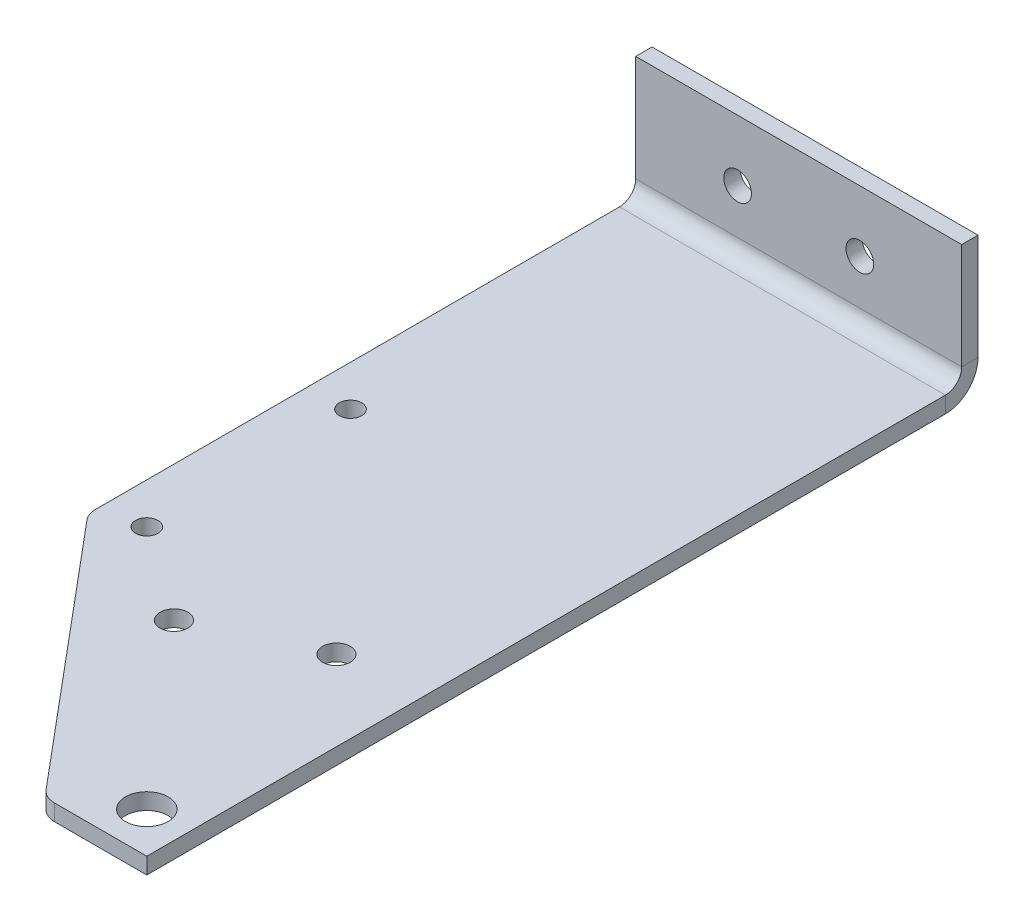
ISO-10303-21;
HEADER;
FILE_DESCRIPTION(('STEP AP214'),'2;1');
FILE_NAME('part.step','',(''),(''),'','','');
FILE_SCHEMA(('AUTOMOTIVE_DESIGN { 1 0 10303 214 1 1 1 1 }'));
ENDSEC;
DATA;
#1=APPLICATION_CONTEXT('core data for automotive mechanical design processes');
#2=APPLICATION_PROTOCOL_DEFINITION('international standard','automotive_design',2000,#1);
#3=PRODUCT_CONTEXT('',#1,'mechanical');
#4=PRODUCT('Part','Part','',(#3));
#5=PRODUCT_RELATED_PRODUCT_CATEGORY('part','',(#4));
#6=PRODUCT_DEFINITION_FORMATION('','',#4);
#7=PRODUCT_DEFINITION_CONTEXT('part definition',#1,'design');
#8=PRODUCT_DEFINITION('design','',#6,#7);
#9=PRODUCT_DEFINITION_SHAPE('','',#8);
#10=(LENGTH_UNIT() NAMED_UNIT(*) SI_UNIT(.MILLI.,.METRE.));
#11=(NAMED_UNIT(*) PLANE_ANGLE_UNIT() SI_UNIT($,.RADIAN.));
#12=(NAMED_UNIT(*) SI_UNIT($,.STERADIAN.) SOLID_ANGLE_UNIT());
#13=UNCERTAINTY_MEASURE_WITH_UNIT(LENGTH_MEASURE(1.E-05),#10,'distance_accuracy_value','');
#14=(GEOMETRIC_REPRESENTATION_CONTEXT(3) GLOBAL_UNCERTAINTY_ASSIGNED_CONTEXT((#13)) GLOBAL_UNIT_ASSIGNED_CONTEXT((#10,
#11,#12)) REPRESENTATION_CONTEXT('',''));
#15=CARTESIAN_POINT('',(0.,0.,0.));
#16=DIRECTION('',(0.,0.,1.));
#17=DIRECTION('',(1.,0.,0.));
#18=AXIS2_PLACEMENT_3D('',#15,#16,#17);
#19=CARTESIAN_POINT('',(-8.32667268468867E-13,-4.,200.));
#20=DIRECTION('',(0.,1.,0.));
#21=DIRECTION('',(0.,0.,1.));
#22=AXIS2_PLACEMENT_3D('',#19,#20,#21);
#23=PLANE('',#22);
#24=CARTESIAN_POINT('',(9.99999999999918,-4.00000000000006,130.));
#25=DIRECTION('',(0.,1.,0.));
#26=DIRECTION('',(0.,0.,1.));
#27=AXIS2_PLACEMENT_3D('',#24,#25,#26);
#28=CIRCLE('',#27,2.75);
#29=CARTESIAN_POINT('',(9.99999999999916,-4.00000000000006,132.75));
#30=VERTEX_POINT('',#29);
#31=EDGE_CURVE('E371',#30,#30,#28,.T.);
#32=ORIENTED_EDGE('',*,*,#31,.T.);
#33=EDGE_LOOP('',(#32));
#34=FACE_BOUND('',#33,.T.);
#35=CARTESIAN_POINT('',(10.,-4.00000000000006,79.9999999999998));
#36=DIRECTION('',(0.,1.,0.));
#37=DIRECTION('',(0.,0.,1.));
#38=AXIS2_PLACEMENT_3D('',#35,#36,#37);
#39=CIRCLE('',#38,2.75);
#40=CARTESIAN_POINT('',(9.99999999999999,-4.00000000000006,82.7499999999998));
#41=VERTEX_POINT('',#40);
#42=EDGE_CURVE('E375',#41,#41,#39,.T.);
#43=ORIENTED_EDGE('',*,*,#42,.T.);
#44=EDGE_LOOP('',(#43));
#45=FACE_BOUND('',#44,.T.);
#46=CARTESIAN_POINT('',(70.,-4.,190.));
#47=DIRECTION('',(0.,1.,0.));
#48=DIRECTION('',(0.,0.,1.));
#49=AXIS2_PLACEMENT_3D('',#46,#47,#48);
#50=CIRCLE('',#49,5.25);
#51=CARTESIAN_POINT('',(70.,-4.,195.25));
#52=VERTEX_POINT('',#51);
#53=EDGE_CURVE('E245',#52,#52,#50,.T.);
#54=ORIENTED_EDGE('',*,*,#53,.T.);
#55=EDGE_LOOP('',(#54));
#56=FACE_BOUND('',#55,.T.);
#57=CARTESIAN_POINT('',(33.1613787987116,-3.99999000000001,146.492345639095));
#58=DIRECTION('',(0.,1.,0.));
#59=DIRECTION('',(0.,0.,1.));
#60=AXIS2_PLACEMENT_3D('',#57,#58,#59);
#61=CIRCLE('',#60,3.4);
#62=CARTESIAN_POINT('',(33.1613787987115,-3.99999000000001,149.892345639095));
#63=VERTEX_POINT('',#62);
#64=EDGE_CURVE('E233',#63,#63,#61,.T.);
#65=ORIENTED_EDGE('',*,*,#64,.T.);
#66=EDGE_LOOP('',(#65));
#67=FACE_BOUND('',#66,.T.);
#68=CARTESIAN_POINT('',(60.350612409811,-3.99999000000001,133.813797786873));
#69=DIRECTION('',(0.,1.,0.));
#70=DIRECTION('',(0.,0.,1.));
#71=AXIS2_PLACEMENT_3D('',#68,#69,#70);
#72=CIRCLE('',#71,3.39999999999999);
#73=CARTESIAN_POINT('',(60.350612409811,-3.99999000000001,137.213797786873));
#74=VERTEX_POINT('',#73);
#75=EDGE_CURVE('E222',#74,#74,#72,.T.);
#76=ORIENTED_EDGE('',*,*,#75,.T.);
#77=EDGE_LOOP('',(#76));
#78=FACE_BOUND('',#77,.T.);
#79=DIRECTION('',(-1.,0.,0.));
#80=VECTOR('',#79,1.);
#81=CARTESIAN_POINT('',(0.,-4.00000000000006,3.99999999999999));
#82=LINE('',#81,#80);
#83=CARTESIAN_POINT('',(0.,-4.00000000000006,3.99999999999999));
#84=VERTEX_POINT('',#83);
#85=CARTESIAN_POINT('',(80.,-4.,3.99999999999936));
#86=VERTEX_POINT('',#85);
#87=EDGE_CURVE('E150',#84,#86,#82,.F.);
#88=ORIENTED_EDGE('',*,*,#87,.T.);
#89=DIRECTION('',(0.,0.,-1.));
#90=VECTOR('',#89,1.);
#91=CARTESIAN_POINT('',(79.9999999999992,-4.,199.999999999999));
#92=LINE('',#91,#90);
#93=CARTESIAN_POINT('',(79.9999999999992,-4.,199.999999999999));
#94=VERTEX_POINT('',#93);
#95=EDGE_CURVE('E270',#94,#86,#92,.T.);
#96=ORIENTED_EDGE('',*,*,#95,.F.);
#97=DIRECTION('',(1.,0.,0.));
#98=VECTOR('',#97,1.);
#99=CARTESIAN_POINT('',(-8.32667268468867E-13,-4.,200.));
#100=LINE('',#99,#98);
#101=CARTESIAN_POINT('',(57.3315382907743,-4.,200.));
#102=VERTEX_POINT('',#101);
#103=EDGE_CURVE('E249',#102,#94,#100,.T.);
#104=ORIENTED_EDGE('',*,*,#103,.F.);
#105=CARTESIAN_POINT('',(57.3315382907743,-4.,195.));
#106=DIRECTION('',(0.,1.,0.));
#107=DIRECTION('',(0.,0.,1.));
#108=AXIS2_PLACEMENT_3D('',#105,#106,#107);
#109=CIRCLE('',#108,5.);
#110=CARTESIAN_POINT('',(53.5013160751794,-4.,198.213938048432));
#111=VERTEX_POINT('',#110);
#112=EDGE_CURVE('E73',#102,#111,#109,.F.);
#113=ORIENTED_EDGE('',*,*,#112,.T.);
#114=DIRECTION('',(-0.642787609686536,0.,-0.766044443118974));
#115=VECTOR('',#114,1.);
#116=CARTESIAN_POINT('',(0.,-4.,134.453552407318));
#117=LINE('',#116,#115);
#118=CARTESIAN_POINT('',(1.16977778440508,-4.,135.84763928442));
#119=VERTEX_POINT('',#118);
#120=EDGE_CURVE('E278',#111,#119,#117,.T.);
#121=ORIENTED_EDGE('',*,*,#120,.T.);
#122=CARTESIAN_POINT('',(4.99999999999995,-4.,132.633701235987));
#123=DIRECTION('',(0.,1.,0.));
#124=DIRECTION('',(0.,0.,1.));
#125=AXIS2_PLACEMENT_3D('',#122,#123,#124);
#126=CIRCLE('',#125,5.);
#127=CARTESIAN_POINT('',(0.,-4.,132.633701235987));
#128=VERTEX_POINT('',#127);
#129=EDGE_CURVE('E65',#119,#128,#126,.F.);
#130=ORIENTED_EDGE('',*,*,#129,.T.);
#131=DIRECTION('',(0.,0.,-1.));
#132=VECTOR('',#131,1.);
#133=CARTESIAN_POINT('',(-8.32667268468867E-13,-4.,200.));
#134=LINE('',#133,#132);
#135=EDGE_CURVE('E259',#128,#84,#134,.T.);
#136=ORIENTED_EDGE('',*,*,#135,.T.);
#137=EDGE_LOOP('',(#88,#96,#104,#113,#121,#130,#136));
#138=FACE_BOUND('',#137,.T.);
#139=ADVANCED_FACE('F56',(#34,#45,#56,#67,#78,#138),#23,.F.);
#140=CARTESIAN_POINT('',(-8.32667268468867E-13,0.,200.));
#141=DIRECTION('',(0.,1.,0.));
#142=DIRECTION('',(0.,0.,1.));
#143=AXIS2_PLACEMENT_3D('',#140,#141,#142);
#144=PLANE('',#143);
#145=CARTESIAN_POINT('',(9.99999999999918,0.,130.));
#146=DIRECTION('',(0.,1.,0.));
#147=DIRECTION('',(0.,0.,1.));
#148=AXIS2_PLACEMENT_3D('',#145,#146,#147);
#149=CIRCLE('',#148,2.74999999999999);
#150=CARTESIAN_POINT('',(9.99999999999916,0.,132.75));
#151=VERTEX_POINT('',#150);
#152=EDGE_CURVE('E645',#151,#151,#149,.T.);
#153=ORIENTED_EDGE('',*,*,#152,.F.);
#154=EDGE_LOOP('',(#153));
#155=FACE_BOUND('',#154,.T.);
#156=CARTESIAN_POINT('',(10.,0.,79.9999999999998));
#157=DIRECTION('',(0.,1.,0.));
#158=DIRECTION('',(0.,0.,1.));
#159=AXIS2_PLACEMENT_3D('',#156,#157,#158);
#160=CIRCLE('',#159,2.74999999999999);
#161=CARTESIAN_POINT('',(9.99999999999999,0.,82.7499999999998));
#162=VERTEX_POINT('',#161);
#163=EDGE_CURVE('E649',#162,#162,#160,.T.);
#164=ORIENTED_EDGE('',*,*,#163,.F.);
#165=EDGE_LOOP('',(#164));
#166=FACE_BOUND('',#165,.T.);
#167=CARTESIAN_POINT('',(70.,0.,190.));
#168=DIRECTION('',(0.,1.,0.));
#169=DIRECTION('',(0.,0.,1.));
#170=AXIS2_PLACEMENT_3D('',#167,#168,#169);
#171=CIRCLE('',#170,5.25);
#172=CARTESIAN_POINT('',(70.,0.,195.25));
#173=VERTEX_POINT('',#172);
#174=EDGE_CURVE('E241',#173,#173,#171,.T.);
#175=ORIENTED_EDGE('',*,*,#174,.F.);
#176=EDGE_LOOP('',(#175));
#177=FACE_BOUND('',#176,.T.);
#178=CARTESIAN_POINT('',(33.1613787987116,0.,146.492345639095));
#179=DIRECTION('',(0.,1.,0.));
#180=DIRECTION('',(0.,0.,1.));
#181=AXIS2_PLACEMENT_3D('',#178,#179,#180);
#182=CIRCLE('',#181,3.4);
#183=CARTESIAN_POINT('',(33.1613787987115,0.,149.892345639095));
#184=VERTEX_POINT('',#183);
#185=EDGE_CURVE('E237',#184,#184,#182,.T.);
#186=ORIENTED_EDGE('',*,*,#185,.F.);
#187=EDGE_LOOP('',(#186));
#188=FACE_BOUND('',#187,.T.);
#189=CARTESIAN_POINT('',(60.350612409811,0.,133.813797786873));
#190=DIRECTION('',(0.,1.,0.));
#191=DIRECTION('',(0.,0.,1.));
#192=AXIS2_PLACEMENT_3D('',#189,#190,#191);
#193=CIRCLE('',#192,3.39999999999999);
#194=CARTESIAN_POINT('',(60.350612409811,0.,137.213797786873));
#195=VERTEX_POINT('',#194);
#196=EDGE_CURVE('E229',#195,#195,#193,.T.);
#197=ORIENTED_EDGE('',*,*,#196,.F.);
#198=EDGE_LOOP('',(#197));
#199=FACE_BOUND('',#198,.T.);
#200=DIRECTION('',(0.,0.,-1.));
#201=VECTOR('',#200,1.);
#202=CARTESIAN_POINT('',(79.9999999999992,0.,199.999999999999));
#203=LINE('',#202,#201);
#204=CARTESIAN_POINT('',(79.9999999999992,0.,199.999999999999));
#205=VERTEX_POINT('',#204);
#206=CARTESIAN_POINT('',(80.,0.,3.99999999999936));
#207=VERTEX_POINT('',#206);
#208=EDGE_CURVE('E266',#205,#207,#203,.T.);
#209=ORIENTED_EDGE('',*,*,#208,.T.);
#210=DIRECTION('',(-1.,0.,0.));
#211=VECTOR('',#210,1.);
#212=CARTESIAN_POINT('',(0.,0.,3.99999999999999));
#213=LINE('',#212,#211);
#214=CARTESIAN_POINT('',(0.,0.,3.99999999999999));
#215=VERTEX_POINT('',#214);
#216=EDGE_CURVE('E207',#215,#207,#213,.F.);
#217=ORIENTED_EDGE('',*,*,#216,.F.);
#218=DIRECTION('',(0.,0.,-1.));
#219=VECTOR('',#218,1.);
#220=CARTESIAN_POINT('',(-8.32667268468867E-13,0.,200.));
#221=LINE('',#220,#219);
#222=CARTESIAN_POINT('',(0.,0.,132.633701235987));
#223=VERTEX_POINT('',#222);
#224=EDGE_CURVE('E262',#223,#215,#221,.T.);
#225=ORIENTED_EDGE('',*,*,#224,.F.);
#226=CARTESIAN_POINT('',(4.99999999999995,0.,132.633701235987));
#227=DIRECTION('',(0.,1.,0.));
#228=DIRECTION('',(0.,0.,1.));
#229=AXIS2_PLACEMENT_3D('',#226,#227,#228);
#230=CIRCLE('',#229,5.);
#231=CARTESIAN_POINT('',(1.16977778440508,0.,135.84763928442));
#232=VERTEX_POINT('',#231);
#233=EDGE_CURVE('E288',#223,#232,#230,.T.);
#234=ORIENTED_EDGE('',*,*,#233,.T.);
#235=DIRECTION('',(0.642787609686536,0.,0.766044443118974));
#236=VECTOR('',#235,1.);
#237=CARTESIAN_POINT('',(32.2753248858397,0.,172.917786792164));
#238=LINE('',#237,#236);
#239=CARTESIAN_POINT('',(53.5013160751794,0.,198.213938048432));
#240=VERTEX_POINT('',#239);
#241=EDGE_CURVE('E274',#232,#240,#238,.T.);
#242=ORIENTED_EDGE('',*,*,#241,.T.);
#243=CARTESIAN_POINT('',(57.3315382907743,0.,195.));
#244=DIRECTION('',(0.,1.,0.));
#245=DIRECTION('',(0.,0.,1.));
#246=AXIS2_PLACEMENT_3D('',#243,#244,#245);
#247=CIRCLE('',#246,5.);
#248=CARTESIAN_POINT('',(57.3315382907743,0.,200.));
#249=VERTEX_POINT('',#248);
#250=EDGE_CURVE('E285',#240,#249,#247,.T.);
#251=ORIENTED_EDGE('',*,*,#250,.T.);
#252=DIRECTION('',(1.,0.,0.));
#253=VECTOR('',#252,1.);
#254=CARTESIAN_POINT('',(-8.32667268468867E-13,0.,200.));
#255=LINE('',#254,#253);
#256=EDGE_CURVE('E256',#249,#205,#255,.T.);
#257=ORIENTED_EDGE('',*,*,#256,.T.);
#258=EDGE_LOOP('',(#209,#217,#225,#234,#242,#251,#257));
#259=FACE_BOUND('',#258,.T.);
#260=ADVANCED_FACE('F344',(#155,#166,#177,#188,#199,#259),#144,.T.);
#261=CARTESIAN_POINT('',(-8.32667268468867E-13,-4.,200.));
#262=DIRECTION('',(-1.,0.,0.));
#263=DIRECTION('',(0.,0.,1.));
#264=AXIS2_PLACEMENT_3D('',#261,#262,#263);
#265=PLANE('',#264);
#266=ORIENTED_EDGE('',*,*,#224,.T.);
#267=DIRECTION('',(0.,-1.,0.));
#268=VECTOR('',#267,1.);
#269=CARTESIAN_POINT('',(0.,0.,3.99999999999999));
#270=LINE('',#269,#268);
#271=EDGE_CURVE('E216',#215,#84,#270,.T.);
#272=ORIENTED_EDGE('',*,*,#271,.T.);
#273=ORIENTED_EDGE('',*,*,#135,.F.);
#274=DIRECTION('',(0.,1.,0.));
#275=VECTOR('',#274,1.);
#276=CARTESIAN_POINT('',(0.,-4.,132.633701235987));
#277=LINE('',#276,#275);
#278=EDGE_CURVE('E281',#128,#223,#277,.T.);
#279=ORIENTED_EDGE('',*,*,#278,.T.);
#280=EDGE_LOOP('',(#266,#272,#273,#279));
#281=FACE_BOUND('',#280,.T.);
#282=ADVANCED_FACE('F359',(#281),#265,.T.);
#283=CARTESIAN_POINT('',(79.9999999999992,0.,199.999999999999));
#284=DIRECTION('',(1.,0.,0.));
#285=DIRECTION('',(0.,0.,-1.));
#286=AXIS2_PLACEMENT_3D('',#283,#284,#285);
#287=PLANE('',#286);
#288=DIRECTION('',(0.,-1.,0.));
#289=VECTOR('',#288,1.);
#290=CARTESIAN_POINT('',(80.,0.,3.99999999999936));
#291=LINE('',#290,#289);
#292=EDGE_CURVE('E218',#207,#86,#291,.T.);
#293=ORIENTED_EDGE('',*,*,#292,.F.);
#294=ORIENTED_EDGE('',*,*,#208,.F.);
#295=DIRECTION('',(0.,-1.,0.));
#296=VECTOR('',#295,1.);
#297=CARTESIAN_POINT('',(79.9999999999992,0.,199.999999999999));
#298=LINE('',#297,#296);
#299=EDGE_CURVE('E252',#205,#94,#298,.T.);
#300=ORIENTED_EDGE('',*,*,#299,.T.);
#301=ORIENTED_EDGE('',*,*,#95,.T.);
#302=EDGE_LOOP('',(#293,#294,#300,#301));
#303=FACE_BOUND('',#302,.T.);
#304=ADVANCED_FACE('F340',(#303),#287,.T.);
#305=CARTESIAN_POINT('',(79.9999999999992,-4.,199.999999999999));
#306=DIRECTION('',(0.,0.,-1.));
#307=DIRECTION('',(-1.,0.,0.));
#308=AXIS2_PLACEMENT_3D('',#305,#306,#307);
#309=PLANE('',#308);
#310=ORIENTED_EDGE('',*,*,#256,.F.);
#311=DIRECTION('',(0.,-1.,0.));
#312=VECTOR('',#311,1.);
#313=CARTESIAN_POINT('',(57.3315382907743,-4.,200.));
#314=LINE('',#313,#312);
#315=EDGE_CURVE('E11',#249,#102,#314,.T.);
#316=ORIENTED_EDGE('',*,*,#315,.T.);
#317=ORIENTED_EDGE('',*,*,#103,.T.);
#318=ORIENTED_EDGE('',*,*,#299,.F.);
#319=EDGE_LOOP('',(#310,#316,#317,#318));
#320=FACE_BOUND('',#319,.T.);
#321=ADVANCED_FACE('F349',(#320),#309,.F.);
#322=CARTESIAN_POINT('',(0.,-4.,134.453552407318));
#323=DIRECTION('',(-0.76604444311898,0.,0.642787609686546));
#324=DIRECTION('',(0.642787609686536,0.,0.766044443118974));
#325=AXIS2_PLACEMENT_3D('',#322,#323,#324);
#326=PLANE('',#325);
#327=ORIENTED_EDGE('',*,*,#241,.F.);
#328=DIRECTION('',(0.,1.,0.));
#329=VECTOR('',#328,1.);
#330=CARTESIAN_POINT('',(1.16977778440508,-4.,135.84763928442));
#331=LINE('',#330,#329);
#332=EDGE_CURVE('E80',#232,#119,#331,.F.);
#333=ORIENTED_EDGE('',*,*,#332,.T.);
#334=ORIENTED_EDGE('',*,*,#120,.F.);
#335=DIRECTION('',(0.,-1.,0.));
#336=VECTOR('',#335,1.);
#337=CARTESIAN_POINT('',(53.5013160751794,0.,198.213938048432));
#338=LINE('',#337,#336);
#339=EDGE_CURVE('E291',#111,#240,#338,.F.);
#340=ORIENTED_EDGE('',*,*,#339,.T.);
#341=EDGE_LOOP('',(#327,#333,#334,#340));
#342=FACE_BOUND('',#341,.T.);
#343=ADVANCED_FACE('F352',(#342),#326,.T.);
#344=CARTESIAN_POINT('',(4.99999999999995,-4.,132.633701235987));
#345=DIRECTION('',(0.,1.,0.));
#346=DIRECTION('',(0.,0.,1.));
#347=AXIS2_PLACEMENT_3D('',#344,#345,#346);
#348=CYLINDRICAL_SURFACE('',#347,5.);
#349=ORIENTED_EDGE('',*,*,#129,.F.);
#350=ORIENTED_EDGE('',*,*,#332,.F.);
#351=ORIENTED_EDGE('',*,*,#233,.F.);
#352=ORIENTED_EDGE('',*,*,#278,.F.);
#353=EDGE_LOOP('',(#349,#350,#351,#352));
#354=FACE_BOUND('',#353,.T.);
#355=ADVANCED_FACE('F356',(#354),#348,.T.);
#356=CARTESIAN_POINT('',(57.3315382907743,-4.,195.));
#357=DIRECTION('',(0.,1.,0.));
#358=DIRECTION('',(0.,0.,1.));
#359=AXIS2_PLACEMENT_3D('',#356,#357,#358);
#360=CYLINDRICAL_SURFACE('',#359,5.);
#361=ORIENTED_EDGE('',*,*,#250,.F.);
#362=ORIENTED_EDGE('',*,*,#339,.F.);
#363=ORIENTED_EDGE('',*,*,#112,.F.);
#364=ORIENTED_EDGE('',*,*,#315,.F.);
#365=EDGE_LOOP('',(#361,#362,#363,#364));
#366=FACE_BOUND('',#365,.T.);
#367=ADVANCED_FACE('F351',(#366),#360,.T.);
#368=CARTESIAN_POINT('',(70.,-4.,190.));
#369=DIRECTION('',(0.,1.,0.));
#370=DIRECTION('',(0.,0.,1.));
#371=AXIS2_PLACEMENT_3D('',#368,#369,#370);
#372=CYLINDRICAL_SURFACE('',#371,5.25);
#373=ORIENTED_EDGE('',*,*,#53,.F.);
#374=EDGE_LOOP('',(#373));
#375=FACE_BOUND('',#374,.T.);
#376=ORIENTED_EDGE('',*,*,#174,.T.);
#377=EDGE_LOOP('',(#376));
#378=FACE_BOUND('',#377,.T.);
#379=ADVANCED_FACE('F394',(#375,#378),#372,.F.);
#380=CARTESIAN_POINT('',(33.1613787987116,0.,146.492345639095));
#381=DIRECTION('',(0.,1.,0.));
#382=DIRECTION('',(0.,0.,1.));
#383=AXIS2_PLACEMENT_3D('',#380,#381,#382);
#384=CYLINDRICAL_SURFACE('',#383,3.4);
#385=ORIENTED_EDGE('',*,*,#64,.F.);
#386=EDGE_LOOP('',(#385));
#387=FACE_BOUND('',#386,.T.);
#388=ORIENTED_EDGE('',*,*,#185,.T.);
#389=EDGE_LOOP('',(#388));
#390=FACE_BOUND('',#389,.T.);
#391=ADVANCED_FACE('F385',(#387,#390),#384,.F.);
#392=CARTESIAN_POINT('',(60.350612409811,0.,133.813797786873));
#393=DIRECTION('',(0.,1.,0.));
#394=DIRECTION('',(0.,0.,1.));
#395=AXIS2_PLACEMENT_3D('',#392,#393,#394);
#396=CYLINDRICAL_SURFACE('',#395,3.39999999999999);
#397=ORIENTED_EDGE('',*,*,#75,.F.);
#398=EDGE_LOOP('',(#397));
#399=FACE_BOUND('',#398,.T.);
#400=ORIENTED_EDGE('',*,*,#196,.T.);
#401=EDGE_LOOP('',(#400));
#402=FACE_BOUND('',#401,.T.);
#403=ADVANCED_FACE('F382',(#399,#402),#396,.F.);
#404=CARTESIAN_POINT('',(80.,3.99999999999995,3.99999999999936));
#405=DIRECTION('',(1.,0.,0.));
#406=DIRECTION('',(0.,0.,-1.));
#407=AXIS2_PLACEMENT_3D('',#404,#405,#406);
#408=PLANE('',#407);
#409=DIRECTION('',(0.,0.,-1.));
#410=VECTOR('',#409,1.);
#411=CARTESIAN_POINT('',(80.,4.,-6.38378239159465E-13));
#412=LINE('',#411,#410);
#413=CARTESIAN_POINT('',(80.,3.99999999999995,-6.38378239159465E-13));
#414=VERTEX_POINT('',#413);
#415=CARTESIAN_POINT('',(80.0000000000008,3.99999999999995,-4.00000000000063));
#416=VERTEX_POINT('',#415);
#417=EDGE_CURVE('E302',#414,#416,#412,.T.);
#418=ORIENTED_EDGE('',*,*,#417,.F.);
#419=CARTESIAN_POINT('',(80.,3.99999999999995,3.99999999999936));
#420=DIRECTION('',(-1.,0.,0.));
#421=DIRECTION('',(0.,0.,1.));
#422=AXIS2_PLACEMENT_3D('',#419,#420,#421);
#423=CIRCLE('',#422,4.);
#424=EDGE_CURVE('E154',#207,#414,#423,.F.);
#425=ORIENTED_EDGE('',*,*,#424,.F.);
#426=ORIENTED_EDGE('',*,*,#292,.T.);
#427=CARTESIAN_POINT('',(80.,3.99999999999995,3.99999999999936));
#428=DIRECTION('',(-1.,0.,0.));
#429=DIRECTION('',(0.,0.,1.));
#430=AXIS2_PLACEMENT_3D('',#427,#428,#429);
#431=CIRCLE('',#430,8.);
#432=EDGE_CURVE('E214',#86,#416,#431,.F.);
#433=ORIENTED_EDGE('',*,*,#432,.T.);
#434=EDGE_LOOP('',(#418,#425,#426,#433));
#435=FACE_BOUND('',#434,.T.);
#436=ADVANCED_FACE('F337',(#435),#408,.T.);
#437=CARTESIAN_POINT('',(0.,3.99999999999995,3.99999999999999));
#438=DIRECTION('',(1.,0.,0.));
#439=DIRECTION('',(0.,0.,-1.));
#440=AXIS2_PLACEMENT_3D('',#437,#438,#439);
#441=PLANE('',#440);
#442=CARTESIAN_POINT('',(0.,3.99999999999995,3.99999999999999));
#443=DIRECTION('',(-1.,0.,0.));
#444=DIRECTION('',(0.,0.,1.));
#445=AXIS2_PLACEMENT_3D('',#442,#443,#444);
#446=CIRCLE('',#445,4.);
#447=CARTESIAN_POINT('',(0.,3.99999999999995,0.));
#448=VERTEX_POINT('',#447);
#449=EDGE_CURVE('E161',#448,#215,#446,.T.);
#450=ORIENTED_EDGE('',*,*,#449,.F.);
#451=DIRECTION('',(0.,0.,-1.));
#452=VECTOR('',#451,1.);
#453=CARTESIAN_POINT('',(0.,4.,0.));
#454=LINE('',#453,#452);
#455=CARTESIAN_POINT('',(8.32667268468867E-13,4.,-4.00000000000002));
#456=VERTEX_POINT('',#455);
#457=EDGE_CURVE('E158',#448,#456,#454,.T.);
#458=ORIENTED_EDGE('',*,*,#457,.T.);
#459=CARTESIAN_POINT('',(0.,3.99999999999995,3.99999999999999));
#460=DIRECTION('',(-1.,0.,0.));
#461=DIRECTION('',(0.,0.,1.));
#462=AXIS2_PLACEMENT_3D('',#459,#460,#461);
#463=CIRCLE('',#462,8.);
#464=EDGE_CURVE('E143',#456,#84,#463,.T.);
#465=ORIENTED_EDGE('',*,*,#464,.T.);
#466=ORIENTED_EDGE('',*,*,#271,.F.);
#467=EDGE_LOOP('',(#450,#458,#465,#466));
#468=FACE_BOUND('',#467,.T.);
#469=ADVANCED_FACE('F159',(#468),#441,.F.);
#470=CARTESIAN_POINT('',(0.,3.99999999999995,3.99999999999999));
#471=DIRECTION('',(-1.,0.,0.));
#472=DIRECTION('',(0.,0.,-1.));
#473=AXIS2_PLACEMENT_3D('',#470,#471,#472);
#474=CYLINDRICAL_SURFACE('',#473,8.);
#475=ORIENTED_EDGE('',*,*,#87,.F.);
#476=ORIENTED_EDGE('',*,*,#464,.F.);
#477=DIRECTION('',(1.,0.,0.));
#478=VECTOR('',#477,1.);
#479=CARTESIAN_POINT('',(80.0000000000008,4.,-4.00000000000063));
#480=LINE('',#479,#478);
#481=EDGE_CURVE('E148',#456,#416,#480,.T.);
#482=ORIENTED_EDGE('',*,*,#481,.T.);
#483=ORIENTED_EDGE('',*,*,#432,.F.);
#484=EDGE_LOOP('',(#475,#476,#482,#483));
#485=FACE_BOUND('',#484,.T.);
#486=ADVANCED_FACE('F145',(#485),#474,.T.);
#487=CARTESIAN_POINT('',(0.,3.99999999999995,3.99999999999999));
#488=DIRECTION('',(-1.,0.,0.));
#489=DIRECTION('',(0.,0.,-1.));
#490=AXIS2_PLACEMENT_3D('',#487,#488,#489);
#491=CYLINDRICAL_SURFACE('',#490,4.);
#492=ORIENTED_EDGE('',*,*,#216,.T.);
#493=ORIENTED_EDGE('',*,*,#424,.T.);
#494=DIRECTION('',(-1.,0.,0.));
#495=VECTOR('',#494,1.);
#496=CARTESIAN_POINT('',(80.,4.,-6.38378239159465E-13));
#497=LINE('',#496,#495);
#498=EDGE_CURVE('E166',#414,#448,#497,.T.);
#499=ORIENTED_EDGE('',*,*,#498,.T.);
#500=ORIENTED_EDGE('',*,*,#449,.T.);
#501=EDGE_LOOP('',(#492,#493,#499,#500));
#502=FACE_BOUND('',#501,.T.);
#503=ADVANCED_FACE('F334',(#502),#491,.F.);
#504=CARTESIAN_POINT('',(8.32667268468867E-13,30.,-4.0000000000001));
#505=DIRECTION('',(1.,0.,0.));
#506=DIRECTION('',(0.,0.,-1.));
#507=AXIS2_PLACEMENT_3D('',#504,#505,#506);
#508=PLANE('',#507);
#509=ORIENTED_EDGE('',*,*,#457,.F.);
#510=DIRECTION('',(0.,1.,0.));
#511=VECTOR('',#510,1.);
#512=CARTESIAN_POINT('',(0.,30.,-1.11022302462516E-13));
#513=LINE('',#512,#511);
#514=CARTESIAN_POINT('',(0.,30.,-1.11022302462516E-13));
#515=VERTEX_POINT('',#514);
#516=EDGE_CURVE('E176',#448,#515,#513,.T.);
#517=ORIENTED_EDGE('',*,*,#516,.T.);
#518=DIRECTION('',(0.,0.,1.));
#519=VECTOR('',#518,1.);
#520=CARTESIAN_POINT('',(8.32667268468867E-13,30.,-4.0000000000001));
#521=LINE('',#520,#519);
#522=CARTESIAN_POINT('',(8.32667268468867E-13,30.,-4.0000000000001));
#523=VERTEX_POINT('',#522);
#524=EDGE_CURVE('E180',#523,#515,#521,.T.);
#525=ORIENTED_EDGE('',*,*,#524,.F.);
#526=DIRECTION('',(0.,1.,0.));
#527=VECTOR('',#526,1.);
#528=CARTESIAN_POINT('',(8.32667268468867E-13,30.,-4.0000000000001));
#529=LINE('',#528,#527);
#530=EDGE_CURVE('E171',#456,#523,#529,.T.);
#531=ORIENTED_EDGE('',*,*,#530,.F.);
#532=EDGE_LOOP('',(#509,#517,#525,#531));
#533=FACE_BOUND('',#532,.T.);
#534=ADVANCED_FACE('F178',(#533),#508,.F.);
#535=CARTESIAN_POINT('',(80.0000000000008,0.,-4.00000000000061));
#536=DIRECTION('',(-1.,0.,0.));
#537=DIRECTION('',(0.,0.,1.));
#538=AXIS2_PLACEMENT_3D('',#535,#536,#537);
#539=PLANE('',#538);
#540=ORIENTED_EDGE('',*,*,#417,.T.);
#541=DIRECTION('',(0.,-1.,0.));
#542=VECTOR('',#541,1.);
#543=CARTESIAN_POINT('',(80.0000000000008,0.,-4.00000000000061));
#544=LINE('',#543,#542);
#545=CARTESIAN_POINT('',(80.0000000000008,30.,-4.00000000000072));
#546=VERTEX_POINT('',#545);
#547=EDGE_CURVE('E174',#546,#416,#544,.T.);
#548=ORIENTED_EDGE('',*,*,#547,.F.);
#549=DIRECTION('',(0.,0.,1.));
#550=VECTOR('',#549,1.);
#551=CARTESIAN_POINT('',(80.0000000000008,30.,-4.00000000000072));
#552=LINE('',#551,#550);
#553=CARTESIAN_POINT('',(80.,30.,-7.21644966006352E-13));
#554=VERTEX_POINT('',#553);
#555=EDGE_CURVE('E198',#546,#554,#552,.T.);
#556=ORIENTED_EDGE('',*,*,#555,.T.);
#557=DIRECTION('',(0.,-1.,0.));
#558=VECTOR('',#557,1.);
#559=CARTESIAN_POINT('',(80.,0.,-6.24500451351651E-13));
#560=LINE('',#559,#558);
#561=EDGE_CURVE('E184',#554,#414,#560,.T.);
#562=ORIENTED_EDGE('',*,*,#561,.T.);
#563=EDGE_LOOP('',(#540,#548,#556,#562));
#564=FACE_BOUND('',#563,.T.);
#565=ADVANCED_FACE('F330',(#564),#539,.F.);
#566=CARTESIAN_POINT('',(80.0000000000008,0.,-4.00000000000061));
#567=DIRECTION('',(0.,0.,1.));
#568=DIRECTION('',(0.,-1.,0.));
#569=AXIS2_PLACEMENT_3D('',#566,#567,#568);
#570=PLANE('',#569);
#571=CARTESIAN_POINT('',(25.0000000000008,15.,-4.00000000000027));
#572=DIRECTION('',(0.,0.,-1.));
#573=DIRECTION('',(0.,1.,0.));
#574=AXIS2_PLACEMENT_3D('',#571,#572,#573);
#575=CIRCLE('',#574,3.4);
#576=CARTESIAN_POINT('',(25.0000000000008,18.4,-4.00000000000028));
#577=VERTEX_POINT('',#576);
#578=EDGE_CURVE('E316',#577,#577,#575,.T.);
#579=ORIENTED_EDGE('',*,*,#578,.F.);
#580=EDGE_LOOP('',(#579));
#581=FACE_BOUND('',#580,.T.);
#582=CARTESIAN_POINT('',(55.0000000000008,15.,-4.00000000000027));
#583=DIRECTION('',(0.,0.,-1.));
#584=DIRECTION('',(0.,1.,0.));
#585=AXIS2_PLACEMENT_3D('',#582,#583,#584);
#586=CIRCLE('',#585,3.4);
#587=CARTESIAN_POINT('',(55.0000000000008,18.4,-4.00000000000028));
#588=VERTEX_POINT('',#587);
#589=EDGE_CURVE('E303',#588,#588,#586,.T.);
#590=ORIENTED_EDGE('',*,*,#589,.F.);
#591=EDGE_LOOP('',(#590));
#592=FACE_BOUND('',#591,.T.);
#593=ORIENTED_EDGE('',*,*,#481,.F.);
#594=ORIENTED_EDGE('',*,*,#530,.T.);
#595=DIRECTION('',(1.,0.,0.));
#596=VECTOR('',#595,1.);
#597=CARTESIAN_POINT('',(80.0000000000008,30.,-4.00000000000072));
#598=LINE('',#597,#596);
#599=EDGE_CURVE('E183',#523,#546,#598,.T.);
#600=ORIENTED_EDGE('',*,*,#599,.T.);
#601=ORIENTED_EDGE('',*,*,#547,.T.);
#602=EDGE_LOOP('',(#593,#594,#600,#601));
#603=FACE_BOUND('',#602,.T.);
#604=ADVANCED_FACE('F170',(#581,#592,#603),#570,.F.);
#605=CARTESIAN_POINT('',(80.,0.,-6.24500451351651E-13));
#606=DIRECTION('',(0.,0.,1.));
#607=DIRECTION('',(0.,-1.,0.));
#608=AXIS2_PLACEMENT_3D('',#605,#606,#607);
#609=PLANE('',#608);
#610=CARTESIAN_POINT('',(25.,15.,-2.63677968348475E-13));
#611=DIRECTION('',(0.,0.,1.));
#612=DIRECTION('',(0.,-1.,0.));
#613=AXIS2_PLACEMENT_3D('',#610,#611,#612);
#614=CIRCLE('',#613,3.4);
#615=CARTESIAN_POINT('',(25.,11.6,-2.51806924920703E-13));
#616=VERTEX_POINT('',#615);
#617=EDGE_CURVE('E59',#616,#616,#614,.T.);
#618=ORIENTED_EDGE('',*,*,#617,.F.);
#619=EDGE_LOOP('',(#618));
#620=FACE_BOUND('',#619,.T.);
#621=CARTESIAN_POINT('',(55.,15.,-2.63677968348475E-13));
#622=DIRECTION('',(0.,0.,1.));
#623=DIRECTION('',(0.,-1.,0.));
#624=AXIS2_PLACEMENT_3D('',#621,#622,#623);
#625=CIRCLE('',#624,3.4);
#626=CARTESIAN_POINT('',(55.,11.6,-2.51806924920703E-13));
#627=VERTEX_POINT('',#626);
#628=EDGE_CURVE('E299',#627,#627,#625,.T.);
#629=ORIENTED_EDGE('',*,*,#628,.F.);
#630=EDGE_LOOP('',(#629));
#631=FACE_BOUND('',#630,.T.);
#632=ORIENTED_EDGE('',*,*,#516,.F.);
#633=ORIENTED_EDGE('',*,*,#498,.F.);
#634=ORIENTED_EDGE('',*,*,#561,.F.);
#635=DIRECTION('',(1.,0.,0.));
#636=VECTOR('',#635,1.);
#637=CARTESIAN_POINT('',(80.,30.,-7.21644966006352E-13));
#638=LINE('',#637,#636);
#639=EDGE_CURVE('E192',#515,#554,#638,.T.);
#640=ORIENTED_EDGE('',*,*,#639,.F.);
#641=EDGE_LOOP('',(#632,#633,#634,#640));
#642=FACE_BOUND('',#641,.T.);
#643=ADVANCED_FACE('F332',(#620,#631,#642),#609,.T.);
#644=CARTESIAN_POINT('',(80.0000000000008,30.,-4.00000000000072));
#645=DIRECTION('',(0.,-1.,0.));
#646=DIRECTION('',(0.,0.,-1.));
#647=AXIS2_PLACEMENT_3D('',#644,#645,#646);
#648=PLANE('',#647);
#649=ORIENTED_EDGE('',*,*,#639,.T.);
#650=ORIENTED_EDGE('',*,*,#555,.F.);
#651=ORIENTED_EDGE('',*,*,#599,.F.);
#652=ORIENTED_EDGE('',*,*,#524,.T.);
#653=EDGE_LOOP('',(#649,#650,#651,#652));
#654=FACE_BOUND('',#653,.T.);
#655=ADVANCED_FACE('F326',(#654),#648,.F.);
#656=CARTESIAN_POINT('',(55.,15.,5.99999999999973));
#657=DIRECTION('',(0.,0.,-1.));
#658=DIRECTION('',(0.,1.,0.));
#659=AXIS2_PLACEMENT_3D('',#656,#657,#658);
#660=CYLINDRICAL_SURFACE('',#659,3.4);
#661=ORIENTED_EDGE('',*,*,#628,.T.);
#662=EDGE_LOOP('',(#661));
#663=FACE_BOUND('',#662,.T.);
#664=ORIENTED_EDGE('',*,*,#589,.T.);
#665=EDGE_LOOP('',(#664));
#666=FACE_BOUND('',#665,.T.);
#667=ADVANCED_FACE('F506',(#663,#666),#660,.F.);
#668=CARTESIAN_POINT('',(25.,15.,5.99999999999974));
#669=DIRECTION('',(0.,0.,-1.));
#670=DIRECTION('',(0.,1.,0.));
#671=AXIS2_PLACEMENT_3D('',#668,#669,#670);
#672=CYLINDRICAL_SURFACE('',#671,3.4);
#673=ORIENTED_EDGE('',*,*,#617,.T.);
#674=EDGE_LOOP('',(#673));
#675=FACE_BOUND('',#674,.T.);
#676=ORIENTED_EDGE('',*,*,#578,.T.);
#677=EDGE_LOOP('',(#676));
#678=FACE_BOUND('',#677,.T.);
#679=ADVANCED_FACE('F514',(#675,#678),#672,.F.);
#680=CARTESIAN_POINT('',(10.,0.,79.9999999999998));
#681=DIRECTION('',(0.,1.,0.));
#682=DIRECTION('',(0.,0.,1.));
#683=AXIS2_PLACEMENT_3D('',#680,#681,#682);
#684=CYLINDRICAL_SURFACE('',#683,2.74999999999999);
#685=ORIENTED_EDGE('',*,*,#42,.F.);
#686=EDGE_LOOP('',(#685));
#687=FACE_BOUND('',#686,.T.);
#688=ORIENTED_EDGE('',*,*,#163,.T.);
#689=EDGE_LOOP('',(#688));
#690=FACE_BOUND('',#689,.T.);
#691=ADVANCED_FACE('F522',(#687,#690),#684,.F.);
#692=CARTESIAN_POINT('',(9.99999999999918,0.,130.));
#693=DIRECTION('',(0.,1.,0.));
#694=DIRECTION('',(0.,0.,1.));
#695=AXIS2_PLACEMENT_3D('',#692,#693,#694);
#696=CYLINDRICAL_SURFACE('',#695,2.74999999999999);
#697=ORIENTED_EDGE('',*,*,#31,.F.);
#698=EDGE_LOOP('',(#697));
#699=FACE_BOUND('',#698,.T.);
#700=ORIENTED_EDGE('',*,*,#152,.T.);
#701=EDGE_LOOP('',(#700));
#702=FACE_BOUND('',#701,.T.);
#703=ADVANCED_FACE('F531',(#699,#702),#696,.F.);
#704=CLOSED_SHELL('',(#139,#260,#282,#304,#321,#343,#355,#367,#379,#391,#403,#436,#469,#486,
#503,#534,#565,#604,#643,#655,#667,#679,#691,#703));
#705=MANIFOLD_SOLID_BREP('B2',#704);
#706=ADVANCED_BREP_SHAPE_REPRESENTATION('',(#18,#705),#14);
#707=SHAPE_DEFINITION_REPRESENTATION(#9,#706);
ENDSEC;
END-ISO-10303-21;
